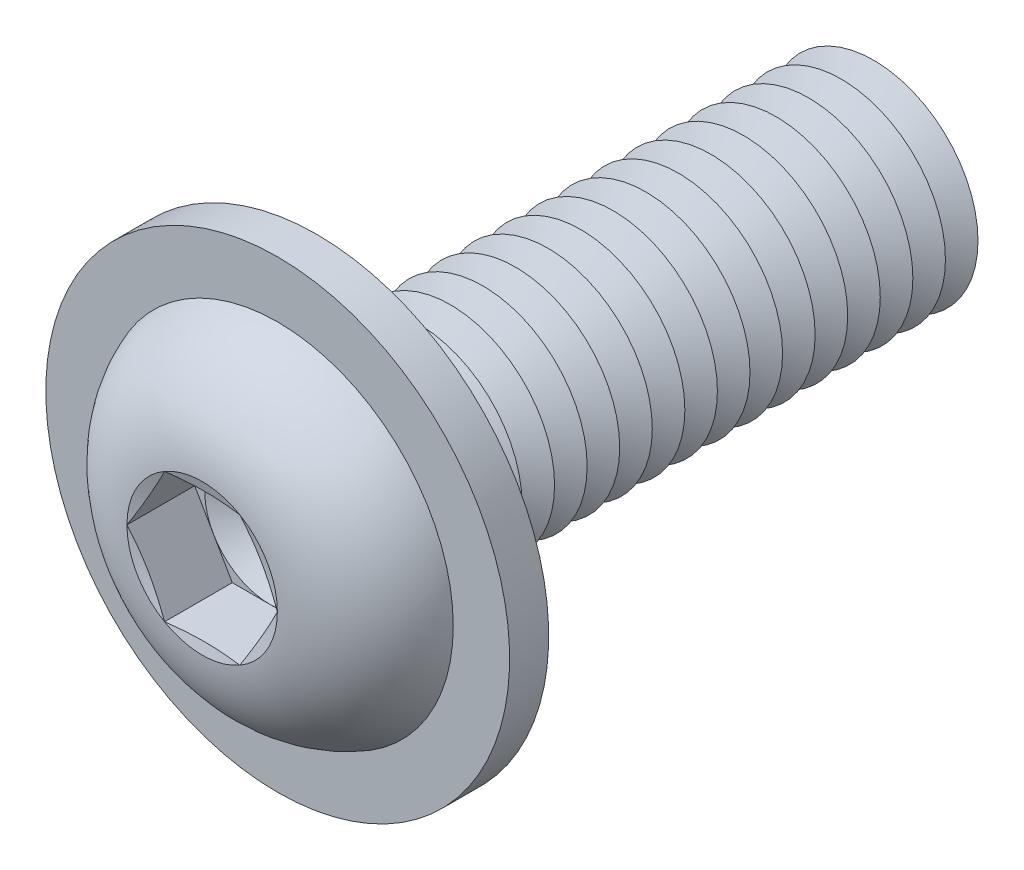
ISO-10303-21;
HEADER;
FILE_DESCRIPTION(('STEP AP214'),'2;1');
FILE_NAME('part.step','',(''),(''),'','','');
FILE_SCHEMA(('AUTOMOTIVE_DESIGN { 1 0 10303 214 1 1 1 1 }'));
ENDSEC;
DATA;
#1=APPLICATION_CONTEXT('core data for automotive mechanical design processes');
#2=APPLICATION_PROTOCOL_DEFINITION('international standard','automotive_design',2000,#1);
#3=PRODUCT_CONTEXT('',#1,'mechanical');
#4=PRODUCT('Part','Part','',(#3));
#5=PRODUCT_RELATED_PRODUCT_CATEGORY('part','',(#4));
#6=PRODUCT_DEFINITION_FORMATION('','',#4);
#7=PRODUCT_DEFINITION_CONTEXT('part definition',#1,'design');
#8=PRODUCT_DEFINITION('design','',#6,#7);
#9=PRODUCT_DEFINITION_SHAPE('','',#8);
#10=(LENGTH_UNIT() NAMED_UNIT(*) SI_UNIT(.MILLI.,.METRE.));
#11=(NAMED_UNIT(*) PLANE_ANGLE_UNIT() SI_UNIT($,.RADIAN.));
#12=(NAMED_UNIT(*) SI_UNIT($,.STERADIAN.) SOLID_ANGLE_UNIT());
#13=UNCERTAINTY_MEASURE_WITH_UNIT(LENGTH_MEASURE(1.E-05),#10,'distance_accuracy_value','');
#14=(GEOMETRIC_REPRESENTATION_CONTEXT(3) GLOBAL_UNCERTAINTY_ASSIGNED_CONTEXT((#13)) GLOBAL_UNIT_ASSIGNED_CONTEXT((#10,
#11,#12)) REPRESENTATION_CONTEXT('',''));
#15=CARTESIAN_POINT('',(0.,0.,0.));
#16=DIRECTION('',(0.,0.,1.));
#17=DIRECTION('',(1.,0.,0.));
#18=AXIS2_PLACEMENT_3D('',#15,#16,#17);
#19=CARTESIAN_POINT('',(0.,0.,-17.625));
#20=DIRECTION('',(0.,0.,1.));
#21=DIRECTION('',(1.,0.,0.));
#22=AXIS2_PLACEMENT_3D('',#19,#20,#21);
#23=CONICAL_SURFACE('',#22,4.00000000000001,1.0471975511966);
#24=CARTESIAN_POINT('',(0.,0.,-18.25));
#25=DIRECTION('',(0.,0.,1.));
#26=DIRECTION('',(1.,0.,0.));
#27=AXIS2_PLACEMENT_3D('',#24,#25,#26);
#28=CIRCLE('',#27,2.91746824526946);
#29=CARTESIAN_POINT('',(2.91746824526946,0.,-18.25));
#30=VERTEX_POINT('',#29);
#31=EDGE_CURVE('E347',#30,#30,#28,.T.);
#32=ORIENTED_EDGE('',*,*,#31,.T.);
#33=EDGE_LOOP('',(#32));
#34=FACE_BOUND('',#33,.T.);
#35=CARTESIAN_POINT('',(0.,0.,-17.625));
#36=DIRECTION('',(0.,0.,1.));
#37=DIRECTION('',(1.,0.,0.));
#38=AXIS2_PLACEMENT_3D('',#35,#36,#37);
#39=CIRCLE('',#38,4.00000000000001);
#40=CARTESIAN_POINT('',(4.00000000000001,0.,-17.625));
#41=VERTEX_POINT('',#40);
#42=EDGE_CURVE('E343',#41,#41,#39,.T.);
#43=ORIENTED_EDGE('',*,*,#42,.F.);
#44=EDGE_LOOP('',(#43));
#45=FACE_BOUND('',#44,.T.);
#46=ADVANCED_FACE('F39',(#34,#45),#23,.T.);
#47=CARTESIAN_POINT('',(0.,0.,-18.25));
#48=DIRECTION('',(0.,0.,-1.));
#49=DIRECTION('',(-1.,0.,0.));
#50=AXIS2_PLACEMENT_3D('',#47,#48,#49);
#51=CONICAL_SURFACE('',#50,2.91746824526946,1.0471975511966);
#52=CARTESIAN_POINT('',(0.,0.,-18.875));
#53=DIRECTION('',(0.,0.,1.));
#54=DIRECTION('',(1.,0.,0.));
#55=AXIS2_PLACEMENT_3D('',#52,#53,#54);
#56=CIRCLE('',#55,4.00000000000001);
#57=CARTESIAN_POINT('',(4.00000000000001,0.,-18.875));
#58=VERTEX_POINT('',#57);
#59=EDGE_CURVE('E351',#58,#58,#56,.T.);
#60=ORIENTED_EDGE('',*,*,#59,.T.);
#61=EDGE_LOOP('',(#60));
#62=FACE_BOUND('',#61,.T.);
#63=ORIENTED_EDGE('',*,*,#31,.F.);
#64=EDGE_LOOP('',(#63));
#65=FACE_BOUND('',#64,.T.);
#66=ADVANCED_FACE('F481',(#62,#65),#51,.T.);
#67=CARTESIAN_POINT('',(0.,4.00000000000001,-22.));
#68=DIRECTION('',(0.,0.,-1.));
#69=DIRECTION('',(-1.,0.,0.));
#70=AXIS2_PLACEMENT_3D('',#67,#68,#69);
#71=PLANE('',#70);
#72=CARTESIAN_POINT('',(0.,0.,-22.));
#73=DIRECTION('',(0.,0.,1.));
#74=DIRECTION('',(1.,0.,0.));
#75=AXIS2_PLACEMENT_3D('',#72,#73,#74);
#76=CIRCLE('',#75,2.91746824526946);
#77=CARTESIAN_POINT('',(2.91746824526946,0.,-22.));
#78=VERTEX_POINT('',#77);
#79=EDGE_CURVE('E371',#78,#78,#76,.T.);
#80=ORIENTED_EDGE('',*,*,#79,.F.);
#81=EDGE_LOOP('',(#80));
#82=FACE_BOUND('',#81,.T.);
#83=ADVANCED_FACE('F487',(#82),#71,.T.);
#84=CARTESIAN_POINT('',(0.,0.,-21.375));
#85=DIRECTION('',(0.,0.,1.));
#86=DIRECTION('',(1.,0.,0.));
#87=AXIS2_PLACEMENT_3D('',#84,#85,#86);
#88=CONICAL_SURFACE('',#87,4.00000000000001,1.0471975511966);
#89=ORIENTED_EDGE('',*,*,#79,.T.);
#90=EDGE_LOOP('',(#89));
#91=FACE_BOUND('',#90,.T.);
#92=CARTESIAN_POINT('',(0.,0.,-21.375));
#93=DIRECTION('',(0.,0.,1.));
#94=DIRECTION('',(1.,0.,0.));
#95=AXIS2_PLACEMENT_3D('',#92,#93,#94);
#96=CIRCLE('',#95,4.00000000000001);
#97=CARTESIAN_POINT('',(4.00000000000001,0.,-21.375));
#98=VERTEX_POINT('',#97);
#99=EDGE_CURVE('E367',#98,#98,#96,.T.);
#100=ORIENTED_EDGE('',*,*,#99,.F.);
#101=EDGE_LOOP('',(#100));
#102=FACE_BOUND('',#101,.T.);
#103=ADVANCED_FACE('F506',(#91,#102),#88,.T.);
#104=CARTESIAN_POINT('',(0.,0.,-20.75));
#105=DIRECTION('',(0.,0.,-1.));
#106=DIRECTION('',(-1.,0.,0.));
#107=AXIS2_PLACEMENT_3D('',#104,#105,#106);
#108=CONICAL_SURFACE('',#107,2.91746824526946,1.0471975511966);
#109=ORIENTED_EDGE('',*,*,#99,.T.);
#110=EDGE_LOOP('',(#109));
#111=FACE_BOUND('',#110,.T.);
#112=CARTESIAN_POINT('',(0.,0.,-20.75));
#113=DIRECTION('',(0.,0.,1.));
#114=DIRECTION('',(1.,0.,0.));
#115=AXIS2_PLACEMENT_3D('',#112,#113,#114);
#116=CIRCLE('',#115,2.91746824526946);
#117=CARTESIAN_POINT('',(2.91746824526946,0.,-20.75));
#118=VERTEX_POINT('',#117);
#119=EDGE_CURVE('E363',#118,#118,#116,.T.);
#120=ORIENTED_EDGE('',*,*,#119,.F.);
#121=EDGE_LOOP('',(#120));
#122=FACE_BOUND('',#121,.T.);
#123=ADVANCED_FACE('F503',(#111,#122),#108,.T.);
#124=CARTESIAN_POINT('',(0.,0.,-20.125));
#125=DIRECTION('',(0.,0.,1.));
#126=DIRECTION('',(1.,0.,0.));
#127=AXIS2_PLACEMENT_3D('',#124,#125,#126);
#128=CONICAL_SURFACE('',#127,4.00000000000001,1.0471975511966);
#129=ORIENTED_EDGE('',*,*,#119,.T.);
#130=EDGE_LOOP('',(#129));
#131=FACE_BOUND('',#130,.T.);
#132=CARTESIAN_POINT('',(0.,0.,-20.125));
#133=DIRECTION('',(0.,0.,1.));
#134=DIRECTION('',(1.,0.,0.));
#135=AXIS2_PLACEMENT_3D('',#132,#133,#134);
#136=CIRCLE('',#135,4.00000000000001);
#137=CARTESIAN_POINT('',(4.00000000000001,0.,-20.125));
#138=VERTEX_POINT('',#137);
#139=EDGE_CURVE('E359',#138,#138,#136,.T.);
#140=ORIENTED_EDGE('',*,*,#139,.F.);
#141=EDGE_LOOP('',(#140));
#142=FACE_BOUND('',#141,.T.);
#143=ADVANCED_FACE('F497',(#131,#142),#128,.T.);
#144=CARTESIAN_POINT('',(0.,0.,-19.5));
#145=DIRECTION('',(0.,0.,-1.));
#146=DIRECTION('',(-1.,0.,0.));
#147=AXIS2_PLACEMENT_3D('',#144,#145,#146);
#148=CONICAL_SURFACE('',#147,2.91746824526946,1.0471975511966);
#149=ORIENTED_EDGE('',*,*,#139,.T.);
#150=EDGE_LOOP('',(#149));
#151=FACE_BOUND('',#150,.T.);
#152=CARTESIAN_POINT('',(0.,0.,-19.5));
#153=DIRECTION('',(0.,0.,1.));
#154=DIRECTION('',(1.,0.,0.));
#155=AXIS2_PLACEMENT_3D('',#152,#153,#154);
#156=CIRCLE('',#155,2.91746824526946);
#157=CARTESIAN_POINT('',(2.91746824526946,0.,-19.5));
#158=VERTEX_POINT('',#157);
#159=EDGE_CURVE('E355',#158,#158,#156,.T.);
#160=ORIENTED_EDGE('',*,*,#159,.F.);
#161=EDGE_LOOP('',(#160));
#162=FACE_BOUND('',#161,.T.);
#163=ADVANCED_FACE('F493',(#151,#162),#148,.T.);
#164=CARTESIAN_POINT('',(0.,0.,-18.875));
#165=DIRECTION('',(0.,0.,1.));
#166=DIRECTION('',(1.,0.,0.));
#167=AXIS2_PLACEMENT_3D('',#164,#165,#166);
#168=CONICAL_SURFACE('',#167,4.00000000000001,1.0471975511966);
#169=ORIENTED_EDGE('',*,*,#159,.T.);
#170=EDGE_LOOP('',(#169));
#171=FACE_BOUND('',#170,.T.);
#172=ORIENTED_EDGE('',*,*,#59,.F.);
#173=EDGE_LOOP('',(#172));
#174=FACE_BOUND('',#173,.T.);
#175=ADVANCED_FACE('F496',(#171,#174),#168,.T.);
#176=CARTESIAN_POINT('',(0.,0.,-16.375));
#177=DIRECTION('',(0.,0.,1.));
#178=DIRECTION('',(1.,0.,0.));
#179=AXIS2_PLACEMENT_3D('',#176,#177,#178);
#180=CONICAL_SURFACE('',#179,4.00000000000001,1.0471975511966);
#181=CARTESIAN_POINT('',(0.,0.,-17.));
#182=DIRECTION('',(0.,0.,1.));
#183=DIRECTION('',(1.,0.,0.));
#184=AXIS2_PLACEMENT_3D('',#181,#182,#183);
#185=CIRCLE('',#184,2.91746824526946);
#186=CARTESIAN_POINT('',(2.91746824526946,0.,-17.));
#187=VERTEX_POINT('',#186);
#188=EDGE_CURVE('E339',#187,#187,#185,.T.);
#189=ORIENTED_EDGE('',*,*,#188,.T.);
#190=EDGE_LOOP('',(#189));
#191=FACE_BOUND('',#190,.T.);
#192=CARTESIAN_POINT('',(0.,0.,-16.375));
#193=DIRECTION('',(0.,0.,1.));
#194=DIRECTION('',(1.,0.,0.));
#195=AXIS2_PLACEMENT_3D('',#192,#193,#194);
#196=CIRCLE('',#195,4.00000000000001);
#197=CARTESIAN_POINT('',(4.00000000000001,0.,-16.375));
#198=VERTEX_POINT('',#197);
#199=EDGE_CURVE('E335',#198,#198,#196,.T.);
#200=ORIENTED_EDGE('',*,*,#199,.F.);
#201=EDGE_LOOP('',(#200));
#202=FACE_BOUND('',#201,.T.);
#203=ADVANCED_FACE('F501',(#191,#202),#180,.T.);
#204=CARTESIAN_POINT('',(0.,0.,-17.));
#205=DIRECTION('',(0.,0.,-1.));
#206=DIRECTION('',(-1.,0.,0.));
#207=AXIS2_PLACEMENT_3D('',#204,#205,#206);
#208=CONICAL_SURFACE('',#207,2.91746824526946,1.0471975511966);
#209=ORIENTED_EDGE('',*,*,#42,.T.);
#210=EDGE_LOOP('',(#209));
#211=FACE_BOUND('',#210,.T.);
#212=ORIENTED_EDGE('',*,*,#188,.F.);
#213=EDGE_LOOP('',(#212));
#214=FACE_BOUND('',#213,.T.);
#215=ADVANCED_FACE('F552',(#211,#214),#208,.T.);
#216=CARTESIAN_POINT('',(0.,0.,-15.125));
#217=DIRECTION('',(0.,0.,1.));
#218=DIRECTION('',(1.,0.,0.));
#219=AXIS2_PLACEMENT_3D('',#216,#217,#218);
#220=CONICAL_SURFACE('',#219,4.00000000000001,1.0471975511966);
#221=CARTESIAN_POINT('',(0.,0.,-15.75));
#222=DIRECTION('',(0.,0.,1.));
#223=DIRECTION('',(1.,0.,0.));
#224=AXIS2_PLACEMENT_3D('',#221,#222,#223);
#225=CIRCLE('',#224,2.91746824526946);
#226=CARTESIAN_POINT('',(2.91746824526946,0.,-15.75));
#227=VERTEX_POINT('',#226);
#228=EDGE_CURVE('E331',#227,#227,#225,.T.);
#229=ORIENTED_EDGE('',*,*,#228,.T.);
#230=EDGE_LOOP('',(#229));
#231=FACE_BOUND('',#230,.T.);
#232=CARTESIAN_POINT('',(0.,0.,-15.125));
#233=DIRECTION('',(0.,0.,1.));
#234=DIRECTION('',(1.,0.,0.));
#235=AXIS2_PLACEMENT_3D('',#232,#233,#234);
#236=CIRCLE('',#235,4.00000000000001);
#237=CARTESIAN_POINT('',(4.00000000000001,0.,-15.125));
#238=VERTEX_POINT('',#237);
#239=EDGE_CURVE('E327',#238,#238,#236,.T.);
#240=ORIENTED_EDGE('',*,*,#239,.F.);
#241=EDGE_LOOP('',(#240));
#242=FACE_BOUND('',#241,.T.);
#243=ADVANCED_FACE('F558',(#231,#242),#220,.T.);
#244=CARTESIAN_POINT('',(0.,0.,-15.75));
#245=DIRECTION('',(0.,0.,-1.));
#246=DIRECTION('',(-1.,0.,0.));
#247=AXIS2_PLACEMENT_3D('',#244,#245,#246);
#248=CONICAL_SURFACE('',#247,2.91746824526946,1.0471975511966);
#249=ORIENTED_EDGE('',*,*,#199,.T.);
#250=EDGE_LOOP('',(#249));
#251=FACE_BOUND('',#250,.T.);
#252=ORIENTED_EDGE('',*,*,#228,.F.);
#253=EDGE_LOOP('',(#252));
#254=FACE_BOUND('',#253,.T.);
#255=ADVANCED_FACE('F565',(#251,#254),#248,.T.);
#256=CARTESIAN_POINT('',(0.,0.,-13.875));
#257=DIRECTION('',(0.,0.,1.));
#258=DIRECTION('',(1.,0.,0.));
#259=AXIS2_PLACEMENT_3D('',#256,#257,#258);
#260=CONICAL_SURFACE('',#259,4.00000000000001,1.0471975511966);
#261=CARTESIAN_POINT('',(0.,0.,-14.5));
#262=DIRECTION('',(0.,0.,1.));
#263=DIRECTION('',(1.,0.,0.));
#264=AXIS2_PLACEMENT_3D('',#261,#262,#263);
#265=CIRCLE('',#264,2.91746824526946);
#266=CARTESIAN_POINT('',(2.91746824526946,0.,-14.5));
#267=VERTEX_POINT('',#266);
#268=EDGE_CURVE('E323',#267,#267,#265,.T.);
#269=ORIENTED_EDGE('',*,*,#268,.T.);
#270=EDGE_LOOP('',(#269));
#271=FACE_BOUND('',#270,.T.);
#272=CARTESIAN_POINT('',(0.,0.,-13.875));
#273=DIRECTION('',(0.,0.,1.));
#274=DIRECTION('',(1.,0.,0.));
#275=AXIS2_PLACEMENT_3D('',#272,#273,#274);
#276=CIRCLE('',#275,4.00000000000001);
#277=CARTESIAN_POINT('',(4.00000000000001,0.,-13.875));
#278=VERTEX_POINT('',#277);
#279=EDGE_CURVE('E319',#278,#278,#276,.T.);
#280=ORIENTED_EDGE('',*,*,#279,.F.);
#281=EDGE_LOOP('',(#280));
#282=FACE_BOUND('',#281,.T.);
#283=ADVANCED_FACE('F572',(#271,#282),#260,.T.);
#284=CARTESIAN_POINT('',(0.,0.,-14.5));
#285=DIRECTION('',(0.,0.,-1.));
#286=DIRECTION('',(-1.,0.,0.));
#287=AXIS2_PLACEMENT_3D('',#284,#285,#286);
#288=CONICAL_SURFACE('',#287,2.91746824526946,1.0471975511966);
#289=ORIENTED_EDGE('',*,*,#239,.T.);
#290=EDGE_LOOP('',(#289));
#291=FACE_BOUND('',#290,.T.);
#292=ORIENTED_EDGE('',*,*,#268,.F.);
#293=EDGE_LOOP('',(#292));
#294=FACE_BOUND('',#293,.T.);
#295=ADVANCED_FACE('F579',(#291,#294),#288,.T.);
#296=CARTESIAN_POINT('',(0.,0.,-12.625));
#297=DIRECTION('',(0.,0.,1.));
#298=DIRECTION('',(1.,0.,0.));
#299=AXIS2_PLACEMENT_3D('',#296,#297,#298);
#300=CONICAL_SURFACE('',#299,4.00000000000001,1.0471975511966);
#301=CARTESIAN_POINT('',(0.,0.,-13.25));
#302=DIRECTION('',(0.,0.,1.));
#303=DIRECTION('',(1.,0.,0.));
#304=AXIS2_PLACEMENT_3D('',#301,#302,#303);
#305=CIRCLE('',#304,2.91746824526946);
#306=CARTESIAN_POINT('',(2.91746824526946,0.,-13.25));
#307=VERTEX_POINT('',#306);
#308=EDGE_CURVE('E315',#307,#307,#305,.T.);
#309=ORIENTED_EDGE('',*,*,#308,.T.);
#310=EDGE_LOOP('',(#309));
#311=FACE_BOUND('',#310,.T.);
#312=CARTESIAN_POINT('',(0.,0.,-12.625));
#313=DIRECTION('',(0.,0.,1.));
#314=DIRECTION('',(1.,0.,0.));
#315=AXIS2_PLACEMENT_3D('',#312,#313,#314);
#316=CIRCLE('',#315,4.00000000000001);
#317=CARTESIAN_POINT('',(4.00000000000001,0.,-12.625));
#318=VERTEX_POINT('',#317);
#319=EDGE_CURVE('E311',#318,#318,#316,.T.);
#320=ORIENTED_EDGE('',*,*,#319,.F.);
#321=EDGE_LOOP('',(#320));
#322=FACE_BOUND('',#321,.T.);
#323=ADVANCED_FACE('F586',(#311,#322),#300,.T.);
#324=CARTESIAN_POINT('',(0.,0.,-13.25));
#325=DIRECTION('',(0.,0.,-1.));
#326=DIRECTION('',(-1.,0.,0.));
#327=AXIS2_PLACEMENT_3D('',#324,#325,#326);
#328=CONICAL_SURFACE('',#327,2.91746824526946,1.0471975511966);
#329=ORIENTED_EDGE('',*,*,#279,.T.);
#330=EDGE_LOOP('',(#329));
#331=FACE_BOUND('',#330,.T.);
#332=ORIENTED_EDGE('',*,*,#308,.F.);
#333=EDGE_LOOP('',(#332));
#334=FACE_BOUND('',#333,.T.);
#335=ADVANCED_FACE('F593',(#331,#334),#328,.T.);
#336=CARTESIAN_POINT('',(0.,0.,-11.375));
#337=DIRECTION('',(0.,0.,1.));
#338=DIRECTION('',(1.,0.,0.));
#339=AXIS2_PLACEMENT_3D('',#336,#337,#338);
#340=CONICAL_SURFACE('',#339,4.00000000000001,1.0471975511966);
#341=CARTESIAN_POINT('',(0.,0.,-12.));
#342=DIRECTION('',(0.,0.,1.));
#343=DIRECTION('',(1.,0.,0.));
#344=AXIS2_PLACEMENT_3D('',#341,#342,#343);
#345=CIRCLE('',#344,2.91746824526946);
#346=CARTESIAN_POINT('',(2.91746824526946,0.,-12.));
#347=VERTEX_POINT('',#346);
#348=EDGE_CURVE('E307',#347,#347,#345,.T.);
#349=ORIENTED_EDGE('',*,*,#348,.T.);
#350=EDGE_LOOP('',(#349));
#351=FACE_BOUND('',#350,.T.);
#352=CARTESIAN_POINT('',(0.,0.,-11.375));
#353=DIRECTION('',(0.,0.,1.));
#354=DIRECTION('',(1.,0.,0.));
#355=AXIS2_PLACEMENT_3D('',#352,#353,#354);
#356=CIRCLE('',#355,4.00000000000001);
#357=CARTESIAN_POINT('',(4.00000000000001,0.,-11.375));
#358=VERTEX_POINT('',#357);
#359=EDGE_CURVE('E303',#358,#358,#356,.T.);
#360=ORIENTED_EDGE('',*,*,#359,.F.);
#361=EDGE_LOOP('',(#360));
#362=FACE_BOUND('',#361,.T.);
#363=ADVANCED_FACE('F600',(#351,#362),#340,.T.);
#364=CARTESIAN_POINT('',(0.,0.,-12.));
#365=DIRECTION('',(0.,0.,-1.));
#366=DIRECTION('',(-1.,0.,0.));
#367=AXIS2_PLACEMENT_3D('',#364,#365,#366);
#368=CONICAL_SURFACE('',#367,2.91746824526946,1.0471975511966);
#369=ORIENTED_EDGE('',*,*,#319,.T.);
#370=EDGE_LOOP('',(#369));
#371=FACE_BOUND('',#370,.T.);
#372=ORIENTED_EDGE('',*,*,#348,.F.);
#373=EDGE_LOOP('',(#372));
#374=FACE_BOUND('',#373,.T.);
#375=ADVANCED_FACE('F607',(#371,#374),#368,.T.);
#376=CARTESIAN_POINT('',(0.,0.,-10.125));
#377=DIRECTION('',(0.,0.,1.));
#378=DIRECTION('',(1.,0.,0.));
#379=AXIS2_PLACEMENT_3D('',#376,#377,#378);
#380=CONICAL_SURFACE('',#379,4.00000000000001,1.0471975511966);
#381=CARTESIAN_POINT('',(0.,0.,-10.75));
#382=DIRECTION('',(0.,0.,1.));
#383=DIRECTION('',(1.,0.,0.));
#384=AXIS2_PLACEMENT_3D('',#381,#382,#383);
#385=CIRCLE('',#384,2.91746824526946);
#386=CARTESIAN_POINT('',(2.91746824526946,0.,-10.75));
#387=VERTEX_POINT('',#386);
#388=EDGE_CURVE('E299',#387,#387,#385,.T.);
#389=ORIENTED_EDGE('',*,*,#388,.T.);
#390=EDGE_LOOP('',(#389));
#391=FACE_BOUND('',#390,.T.);
#392=CARTESIAN_POINT('',(0.,0.,-10.125));
#393=DIRECTION('',(0.,0.,1.));
#394=DIRECTION('',(1.,0.,0.));
#395=AXIS2_PLACEMENT_3D('',#392,#393,#394);
#396=CIRCLE('',#395,4.00000000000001);
#397=CARTESIAN_POINT('',(4.00000000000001,0.,-10.125));
#398=VERTEX_POINT('',#397);
#399=EDGE_CURVE('E295',#398,#398,#396,.T.);
#400=ORIENTED_EDGE('',*,*,#399,.F.);
#401=EDGE_LOOP('',(#400));
#402=FACE_BOUND('',#401,.T.);
#403=ADVANCED_FACE('F614',(#391,#402),#380,.T.);
#404=CARTESIAN_POINT('',(0.,0.,-10.75));
#405=DIRECTION('',(0.,0.,-1.));
#406=DIRECTION('',(-1.,0.,0.));
#407=AXIS2_PLACEMENT_3D('',#404,#405,#406);
#408=CONICAL_SURFACE('',#407,2.91746824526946,1.0471975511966);
#409=ORIENTED_EDGE('',*,*,#359,.T.);
#410=EDGE_LOOP('',(#409));
#411=FACE_BOUND('',#410,.T.);
#412=ORIENTED_EDGE('',*,*,#388,.F.);
#413=EDGE_LOOP('',(#412));
#414=FACE_BOUND('',#413,.T.);
#415=ADVANCED_FACE('F621',(#411,#414),#408,.T.);
#416=CARTESIAN_POINT('',(0.,0.,-8.875));
#417=DIRECTION('',(0.,0.,1.));
#418=DIRECTION('',(1.,0.,0.));
#419=AXIS2_PLACEMENT_3D('',#416,#417,#418);
#420=CONICAL_SURFACE('',#419,4.00000000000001,1.0471975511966);
#421=CARTESIAN_POINT('',(0.,0.,-9.5));
#422=DIRECTION('',(0.,0.,1.));
#423=DIRECTION('',(1.,0.,0.));
#424=AXIS2_PLACEMENT_3D('',#421,#422,#423);
#425=CIRCLE('',#424,2.91746824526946);
#426=CARTESIAN_POINT('',(2.91746824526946,0.,-9.5));
#427=VERTEX_POINT('',#426);
#428=EDGE_CURVE('E291',#427,#427,#425,.T.);
#429=ORIENTED_EDGE('',*,*,#428,.T.);
#430=EDGE_LOOP('',(#429));
#431=FACE_BOUND('',#430,.T.);
#432=CARTESIAN_POINT('',(0.,0.,-8.875));
#433=DIRECTION('',(0.,0.,1.));
#434=DIRECTION('',(1.,0.,0.));
#435=AXIS2_PLACEMENT_3D('',#432,#433,#434);
#436=CIRCLE('',#435,4.00000000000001);
#437=CARTESIAN_POINT('',(4.00000000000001,0.,-8.875));
#438=VERTEX_POINT('',#437);
#439=EDGE_CURVE('E287',#438,#438,#436,.T.);
#440=ORIENTED_EDGE('',*,*,#439,.F.);
#441=EDGE_LOOP('',(#440));
#442=FACE_BOUND('',#441,.T.);
#443=ADVANCED_FACE('F628',(#431,#442),#420,.T.);
#444=CARTESIAN_POINT('',(0.,0.,-9.5));
#445=DIRECTION('',(0.,0.,-1.));
#446=DIRECTION('',(-1.,0.,0.));
#447=AXIS2_PLACEMENT_3D('',#444,#445,#446);
#448=CONICAL_SURFACE('',#447,2.91746824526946,1.0471975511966);
#449=ORIENTED_EDGE('',*,*,#399,.T.);
#450=EDGE_LOOP('',(#449));
#451=FACE_BOUND('',#450,.T.);
#452=ORIENTED_EDGE('',*,*,#428,.F.);
#453=EDGE_LOOP('',(#452));
#454=FACE_BOUND('',#453,.T.);
#455=ADVANCED_FACE('F635',(#451,#454),#448,.T.);
#456=CARTESIAN_POINT('',(0.,0.,-7.625));
#457=DIRECTION('',(0.,0.,1.));
#458=DIRECTION('',(1.,0.,0.));
#459=AXIS2_PLACEMENT_3D('',#456,#457,#458);
#460=CONICAL_SURFACE('',#459,4.00000000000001,1.0471975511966);
#461=CARTESIAN_POINT('',(0.,0.,-8.25));
#462=DIRECTION('',(0.,0.,1.));
#463=DIRECTION('',(1.,0.,0.));
#464=AXIS2_PLACEMENT_3D('',#461,#462,#463);
#465=CIRCLE('',#464,2.91746824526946);
#466=CARTESIAN_POINT('',(2.91746824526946,0.,-8.25));
#467=VERTEX_POINT('',#466);
#468=EDGE_CURVE('E283',#467,#467,#465,.T.);
#469=ORIENTED_EDGE('',*,*,#468,.T.);
#470=EDGE_LOOP('',(#469));
#471=FACE_BOUND('',#470,.T.);
#472=CARTESIAN_POINT('',(0.,0.,-7.625));
#473=DIRECTION('',(0.,0.,1.));
#474=DIRECTION('',(1.,0.,0.));
#475=AXIS2_PLACEMENT_3D('',#472,#473,#474);
#476=CIRCLE('',#475,4.00000000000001);
#477=CARTESIAN_POINT('',(4.00000000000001,0.,-7.625));
#478=VERTEX_POINT('',#477);
#479=EDGE_CURVE('E279',#478,#478,#476,.T.);
#480=ORIENTED_EDGE('',*,*,#479,.F.);
#481=EDGE_LOOP('',(#480));
#482=FACE_BOUND('',#481,.T.);
#483=ADVANCED_FACE('F642',(#471,#482),#460,.T.);
#484=CARTESIAN_POINT('',(0.,0.,-8.25));
#485=DIRECTION('',(0.,0.,-1.));
#486=DIRECTION('',(-1.,0.,0.));
#487=AXIS2_PLACEMENT_3D('',#484,#485,#486);
#488=CONICAL_SURFACE('',#487,2.91746824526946,1.0471975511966);
#489=ORIENTED_EDGE('',*,*,#439,.T.);
#490=EDGE_LOOP('',(#489));
#491=FACE_BOUND('',#490,.T.);
#492=ORIENTED_EDGE('',*,*,#468,.F.);
#493=EDGE_LOOP('',(#492));
#494=FACE_BOUND('',#493,.T.);
#495=ADVANCED_FACE('F649',(#491,#494),#488,.T.);
#496=CARTESIAN_POINT('',(0.,0.,-6.375));
#497=DIRECTION('',(0.,0.,1.));
#498=DIRECTION('',(1.,0.,0.));
#499=AXIS2_PLACEMENT_3D('',#496,#497,#498);
#500=CONICAL_SURFACE('',#499,4.00000000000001,1.0471975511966);
#501=CARTESIAN_POINT('',(0.,0.,-7.));
#502=DIRECTION('',(0.,0.,1.));
#503=DIRECTION('',(1.,0.,0.));
#504=AXIS2_PLACEMENT_3D('',#501,#502,#503);
#505=CIRCLE('',#504,2.91746824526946);
#506=CARTESIAN_POINT('',(2.91746824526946,0.,-7.));
#507=VERTEX_POINT('',#506);
#508=EDGE_CURVE('E275',#507,#507,#505,.T.);
#509=ORIENTED_EDGE('',*,*,#508,.T.);
#510=EDGE_LOOP('',(#509));
#511=FACE_BOUND('',#510,.T.);
#512=CARTESIAN_POINT('',(0.,0.,-6.375));
#513=DIRECTION('',(0.,0.,1.));
#514=DIRECTION('',(1.,0.,0.));
#515=AXIS2_PLACEMENT_3D('',#512,#513,#514);
#516=CIRCLE('',#515,4.00000000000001);
#517=CARTESIAN_POINT('',(4.00000000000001,0.,-6.375));
#518=VERTEX_POINT('',#517);
#519=EDGE_CURVE('E271',#518,#518,#516,.T.);
#520=ORIENTED_EDGE('',*,*,#519,.F.);
#521=EDGE_LOOP('',(#520));
#522=FACE_BOUND('',#521,.T.);
#523=ADVANCED_FACE('F656',(#511,#522),#500,.T.);
#524=CARTESIAN_POINT('',(0.,0.,-7.));
#525=DIRECTION('',(0.,0.,-1.));
#526=DIRECTION('',(-1.,0.,0.));
#527=AXIS2_PLACEMENT_3D('',#524,#525,#526);
#528=CONICAL_SURFACE('',#527,2.91746824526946,1.0471975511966);
#529=ORIENTED_EDGE('',*,*,#479,.T.);
#530=EDGE_LOOP('',(#529));
#531=FACE_BOUND('',#530,.T.);
#532=ORIENTED_EDGE('',*,*,#508,.F.);
#533=EDGE_LOOP('',(#532));
#534=FACE_BOUND('',#533,.T.);
#535=ADVANCED_FACE('F663',(#531,#534),#528,.T.);
#536=CARTESIAN_POINT('',(0.,0.,-5.125));
#537=DIRECTION('',(0.,0.,1.));
#538=DIRECTION('',(1.,0.,0.));
#539=AXIS2_PLACEMENT_3D('',#536,#537,#538);
#540=CONICAL_SURFACE('',#539,4.00000000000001,1.0471975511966);
#541=CARTESIAN_POINT('',(0.,0.,-5.75));
#542=DIRECTION('',(0.,0.,1.));
#543=DIRECTION('',(1.,0.,0.));
#544=AXIS2_PLACEMENT_3D('',#541,#542,#543);
#545=CIRCLE('',#544,2.91746824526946);
#546=CARTESIAN_POINT('',(2.91746824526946,0.,-5.75));
#547=VERTEX_POINT('',#546);
#548=EDGE_CURVE('E267',#547,#547,#545,.T.);
#549=ORIENTED_EDGE('',*,*,#548,.T.);
#550=EDGE_LOOP('',(#549));
#551=FACE_BOUND('',#550,.T.);
#552=CARTESIAN_POINT('',(0.,0.,-5.125));
#553=DIRECTION('',(0.,0.,1.));
#554=DIRECTION('',(1.,0.,0.));
#555=AXIS2_PLACEMENT_3D('',#552,#553,#554);
#556=CIRCLE('',#555,4.00000000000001);
#557=CARTESIAN_POINT('',(4.00000000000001,0.,-5.125));
#558=VERTEX_POINT('',#557);
#559=EDGE_CURVE('E263',#558,#558,#556,.T.);
#560=ORIENTED_EDGE('',*,*,#559,.F.);
#561=EDGE_LOOP('',(#560));
#562=FACE_BOUND('',#561,.T.);
#563=ADVANCED_FACE('F670',(#551,#562),#540,.T.);
#564=CARTESIAN_POINT('',(0.,0.,-5.75));
#565=DIRECTION('',(0.,0.,-1.));
#566=DIRECTION('',(-1.,0.,0.));
#567=AXIS2_PLACEMENT_3D('',#564,#565,#566);
#568=CONICAL_SURFACE('',#567,2.91746824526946,1.0471975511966);
#569=ORIENTED_EDGE('',*,*,#519,.T.);
#570=EDGE_LOOP('',(#569));
#571=FACE_BOUND('',#570,.T.);
#572=ORIENTED_EDGE('',*,*,#548,.F.);
#573=EDGE_LOOP('',(#572));
#574=FACE_BOUND('',#573,.T.);
#575=ADVANCED_FACE('F677',(#571,#574),#568,.T.);
#576=CARTESIAN_POINT('',(0.,0.,-3.875));
#577=DIRECTION('',(0.,0.,1.));
#578=DIRECTION('',(1.,0.,0.));
#579=AXIS2_PLACEMENT_3D('',#576,#577,#578);
#580=CONICAL_SURFACE('',#579,4.00000000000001,1.0471975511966);
#581=CARTESIAN_POINT('',(0.,0.,-4.5));
#582=DIRECTION('',(0.,0.,1.));
#583=DIRECTION('',(1.,0.,0.));
#584=AXIS2_PLACEMENT_3D('',#581,#582,#583);
#585=CIRCLE('',#584,2.91746824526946);
#586=CARTESIAN_POINT('',(2.91746824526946,0.,-4.5));
#587=VERTEX_POINT('',#586);
#588=EDGE_CURVE('E259',#587,#587,#585,.T.);
#589=ORIENTED_EDGE('',*,*,#588,.T.);
#590=EDGE_LOOP('',(#589));
#591=FACE_BOUND('',#590,.T.);
#592=CARTESIAN_POINT('',(0.,0.,-3.875));
#593=DIRECTION('',(0.,0.,1.));
#594=DIRECTION('',(1.,0.,0.));
#595=AXIS2_PLACEMENT_3D('',#592,#593,#594);
#596=CIRCLE('',#595,4.00000000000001);
#597=CARTESIAN_POINT('',(4.00000000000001,0.,-3.875));
#598=VERTEX_POINT('',#597);
#599=EDGE_CURVE('E255',#598,#598,#596,.T.);
#600=ORIENTED_EDGE('',*,*,#599,.F.);
#601=EDGE_LOOP('',(#600));
#602=FACE_BOUND('',#601,.T.);
#603=ADVANCED_FACE('F684',(#591,#602),#580,.T.);
#604=CARTESIAN_POINT('',(0.,0.,-4.5));
#605=DIRECTION('',(0.,0.,-1.));
#606=DIRECTION('',(-1.,0.,0.));
#607=AXIS2_PLACEMENT_3D('',#604,#605,#606);
#608=CONICAL_SURFACE('',#607,2.91746824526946,1.0471975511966);
#609=ORIENTED_EDGE('',*,*,#559,.T.);
#610=EDGE_LOOP('',(#609));
#611=FACE_BOUND('',#610,.T.);
#612=ORIENTED_EDGE('',*,*,#588,.F.);
#613=EDGE_LOOP('',(#612));
#614=FACE_BOUND('',#613,.T.);
#615=ADVANCED_FACE('F691',(#611,#614),#608,.T.);
#616=CARTESIAN_POINT('',(0.,0.,-2.625));
#617=DIRECTION('',(0.,0.,1.));
#618=DIRECTION('',(1.,0.,0.));
#619=AXIS2_PLACEMENT_3D('',#616,#617,#618);
#620=CONICAL_SURFACE('',#619,4.00000000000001,1.0471975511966);
#621=CARTESIAN_POINT('',(0.,0.,-3.25));
#622=DIRECTION('',(0.,0.,1.));
#623=DIRECTION('',(1.,0.,0.));
#624=AXIS2_PLACEMENT_3D('',#621,#622,#623);
#625=CIRCLE('',#624,2.91746824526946);
#626=CARTESIAN_POINT('',(2.91746824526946,0.,-3.25));
#627=VERTEX_POINT('',#626);
#628=EDGE_CURVE('E251',#627,#627,#625,.T.);
#629=ORIENTED_EDGE('',*,*,#628,.T.);
#630=EDGE_LOOP('',(#629));
#631=FACE_BOUND('',#630,.T.);
#632=CARTESIAN_POINT('',(0.,0.,-2.625));
#633=DIRECTION('',(0.,0.,1.));
#634=DIRECTION('',(1.,0.,0.));
#635=AXIS2_PLACEMENT_3D('',#632,#633,#634);
#636=CIRCLE('',#635,4.00000000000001);
#637=CARTESIAN_POINT('',(4.00000000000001,0.,-2.625));
#638=VERTEX_POINT('',#637);
#639=EDGE_CURVE('E243',#638,#638,#636,.T.);
#640=ORIENTED_EDGE('',*,*,#639,.F.);
#641=EDGE_LOOP('',(#640));
#642=FACE_BOUND('',#641,.T.);
#643=ADVANCED_FACE('F698',(#631,#642),#620,.T.);
#644=CARTESIAN_POINT('',(0.,0.,-3.25));
#645=DIRECTION('',(0.,0.,-1.));
#646=DIRECTION('',(-1.,0.,0.));
#647=AXIS2_PLACEMENT_3D('',#644,#645,#646);
#648=CONICAL_SURFACE('',#647,2.91746824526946,1.0471975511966);
#649=ORIENTED_EDGE('',*,*,#599,.T.);
#650=EDGE_LOOP('',(#649));
#651=FACE_BOUND('',#650,.T.);
#652=ORIENTED_EDGE('',*,*,#628,.F.);
#653=EDGE_LOOP('',(#652));
#654=FACE_BOUND('',#653,.T.);
#655=ADVANCED_FACE('F705',(#651,#654),#648,.T.);
#656=CARTESIAN_POINT('',(0.,0.,-1.375));
#657=DIRECTION('',(0.,0.,1.));
#658=DIRECTION('',(1.,0.,0.));
#659=AXIS2_PLACEMENT_3D('',#656,#657,#658);
#660=CONICAL_SURFACE('',#659,4.00000000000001,1.0471975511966);
#661=CARTESIAN_POINT('',(0.,0.,-2.));
#662=DIRECTION('',(0.,0.,1.));
#663=DIRECTION('',(1.,0.,0.));
#664=AXIS2_PLACEMENT_3D('',#661,#662,#663);
#665=CIRCLE('',#664,2.91746824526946);
#666=CARTESIAN_POINT('',(2.91746824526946,0.,-2.));
#667=VERTEX_POINT('',#666);
#668=EDGE_CURVE('E232',#667,#667,#665,.T.);
#669=ORIENTED_EDGE('',*,*,#668,.T.);
#670=EDGE_LOOP('',(#669));
#671=FACE_BOUND('',#670,.T.);
#672=CARTESIAN_POINT('',(0.,0.,-1.375));
#673=DIRECTION('',(0.,0.,1.));
#674=DIRECTION('',(1.,0.,0.));
#675=AXIS2_PLACEMENT_3D('',#672,#673,#674);
#676=CIRCLE('',#675,4.00000000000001);
#677=CARTESIAN_POINT('',(4.00000000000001,0.,-1.375));
#678=VERTEX_POINT('',#677);
#679=EDGE_CURVE('E247',#678,#678,#676,.T.);
#680=ORIENTED_EDGE('',*,*,#679,.F.);
#681=EDGE_LOOP('',(#680));
#682=FACE_BOUND('',#681,.T.);
#683=ADVANCED_FACE('F712',(#671,#682),#660,.T.);
#684=CARTESIAN_POINT('',(0.,0.,-2.));
#685=DIRECTION('',(0.,0.,-1.));
#686=DIRECTION('',(-1.,0.,0.));
#687=AXIS2_PLACEMENT_3D('',#684,#685,#686);
#688=CONICAL_SURFACE('',#687,2.91746824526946,1.0471975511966);
#689=ORIENTED_EDGE('',*,*,#639,.T.);
#690=EDGE_LOOP('',(#689));
#691=FACE_BOUND('',#690,.T.);
#692=ORIENTED_EDGE('',*,*,#668,.F.);
#693=EDGE_LOOP('',(#692));
#694=FACE_BOUND('',#693,.T.);
#695=ADVANCED_FACE('F221',(#691,#694),#688,.T.);
#696=CARTESIAN_POINT('',(0.,4.,0.));
#697=DIRECTION('',(0.,0.,-1.));
#698=DIRECTION('',(-1.,0.,0.));
#699=AXIS2_PLACEMENT_3D('',#696,#697,#698);
#700=PLANE('',#699);
#701=CARTESIAN_POINT('',(0.,0.,0.));
#702=DIRECTION('',(0.,0.,-1.));
#703=DIRECTION('',(-1.,0.,0.));
#704=AXIS2_PLACEMENT_3D('',#701,#702,#703);
#705=CIRCLE('',#704,4.62500000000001);
#706=CARTESIAN_POINT('',(-4.62500000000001,0.,0.));
#707=VERTEX_POINT('',#706);
#708=EDGE_CURVE('E384',#707,#707,#705,.F.);
#709=ORIENTED_EDGE('',*,*,#708,.T.);
#710=EDGE_LOOP('',(#709));
#711=FACE_BOUND('',#710,.T.);
#712=CARTESIAN_POINT('',(0.,0.,0.));
#713=DIRECTION('',(0.,0.,-1.));
#714=DIRECTION('',(0.,1.,0.));
#715=AXIS2_PLACEMENT_3D('',#712,#713,#714);
#716=CIRCLE('',#715,8.9);
#717=CARTESIAN_POINT('',(0.,8.9,0.));
#718=VERTEX_POINT('',#717);
#719=EDGE_CURVE('E1084',#718,#718,#716,.T.);
#720=ORIENTED_EDGE('',*,*,#719,.T.);
#721=EDGE_LOOP('',(#720));
#722=FACE_BOUND('',#721,.T.);
#723=ADVANCED_FACE('F724',(#711,#722),#700,.T.);
#724=CARTESIAN_POINT('',(0.,0.,-0.625000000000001));
#725=DIRECTION('',(0.,0.,-1.));
#726=DIRECTION('',(-1.,0.,0.));
#727=AXIS2_PLACEMENT_3D('',#724,#725,#726);
#728=TOROIDAL_SURFACE('',#727,4.62500000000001,0.625);
#729=ORIENTED_EDGE('',*,*,#708,.F.);
#730=EDGE_LOOP('',(#729));
#731=FACE_BOUND('',#730,.T.);
#732=CARTESIAN_POINT('',(0.,0.,-0.625000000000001));
#733=DIRECTION('',(0.,0.,-1.));
#734=DIRECTION('',(-1.,0.,0.));
#735=AXIS2_PLACEMENT_3D('',#732,#733,#734);
#736=CIRCLE('',#735,4.00000000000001);
#737=CARTESIAN_POINT('',(-4.00000000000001,0.,-0.625000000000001));
#738=VERTEX_POINT('',#737);
#739=EDGE_CURVE('E379',#738,#738,#736,.T.);
#740=ORIENTED_EDGE('',*,*,#739,.F.);
#741=EDGE_LOOP('',(#740));
#742=FACE_BOUND('',#741,.T.);
#743=ADVANCED_FACE('F41',(#731,#742),#728,.F.);
#744=CARTESIAN_POINT('',(0.,0.,-22.));
#745=DIRECTION('',(0.,0.,-1.));
#746=DIRECTION('',(-1.,0.,0.));
#747=AXIS2_PLACEMENT_3D('',#744,#745,#746);
#748=CYLINDRICAL_SURFACE('',#747,4.00000000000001);
#749=ORIENTED_EDGE('',*,*,#739,.T.);
#750=EDGE_LOOP('',(#749));
#751=FACE_BOUND('',#750,.T.);
#752=ORIENTED_EDGE('',*,*,#679,.T.);
#753=EDGE_LOOP('',(#752));
#754=FACE_BOUND('',#753,.T.);
#755=ADVANCED_FACE('F736',(#751,#754),#748,.T.);
#756=CARTESIAN_POINT('',(0.,0.,1.5));
#757=DIRECTION('',(0.,0.,-1.));
#758=DIRECTION('',(0.,1.,0.));
#759=AXIS2_PLACEMENT_3D('',#756,#757,#758);
#760=CYLINDRICAL_SURFACE('',#759,8.9);
#761=CARTESIAN_POINT('',(0.,0.,1.5));
#762=DIRECTION('',(0.,0.,-1.));
#763=DIRECTION('',(0.,1.,0.));
#764=AXIS2_PLACEMENT_3D('',#761,#762,#763);
#765=CIRCLE('',#764,8.9);
#766=CARTESIAN_POINT('',(0.,8.9,1.5));
#767=VERTEX_POINT('',#766);
#768=EDGE_CURVE('E1083',#767,#767,#765,.T.);
#769=ORIENTED_EDGE('',*,*,#768,.T.);
#770=EDGE_LOOP('',(#769));
#771=FACE_BOUND('',#770,.T.);
#772=ORIENTED_EDGE('',*,*,#719,.F.);
#773=EDGE_LOOP('',(#772));
#774=FACE_BOUND('',#773,.T.);
#775=ADVANCED_FACE('F742',(#771,#774),#760,.T.);
#776=CARTESIAN_POINT('',(0.,0.,1.5));
#777=DIRECTION('',(0.,0.,-1.));
#778=DIRECTION('',(0.,1.,0.));
#779=AXIS2_PLACEMENT_3D('',#776,#777,#778);
#780=PLANE('',#779);
#781=CARTESIAN_POINT('',(0.,0.,1.5));
#782=DIRECTION('',(0.,0.,-1.));
#783=DIRECTION('',(0.,1.,0.));
#784=AXIS2_PLACEMENT_3D('',#781,#782,#783);
#785=CIRCLE('',#784,6.73705889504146);
#786=CARTESIAN_POINT('',(0.,6.73705889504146,1.5));
#787=VERTEX_POINT('',#786);
#788=EDGE_CURVE('E43',#787,#787,#785,.F.);
#789=ORIENTED_EDGE('',*,*,#788,.F.);
#790=EDGE_LOOP('',(#789));
#791=FACE_BOUND('',#790,.T.);
#792=ORIENTED_EDGE('',*,*,#768,.F.);
#793=EDGE_LOOP('',(#792));
#794=FACE_BOUND('',#793,.T.);
#795=ADVANCED_FACE('F117',(#791,#794),#780,.F.);
#796=CARTESIAN_POINT('',(0.,0.,1.8));
#797=DIRECTION('',(0.,0.,1.));
#798=DIRECTION('',(1.,0.,0.));
#799=AXIS2_PLACEMENT_3D('',#796,#797,#798);
#800=CONICAL_SURFACE('',#799,2.49999883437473,1.0471975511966);
#801=CARTESIAN_POINT('',(0.,0.,0.35662500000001));
#802=VERTEX_POINT('',#801);
#803=VERTEX_LOOP('',#802);
#804=FACE_BOUND('',#803,.T.);
#805=CARTESIAN_POINT('',(0.,0.,1.8));
#806=DIRECTION('',(0.,0.,1.));
#807=DIRECTION('',(1.,0.,0.));
#808=AXIS2_PLACEMENT_3D('',#805,#806,#807);
#809=CIRCLE('',#808,2.49999883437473);
#810=CARTESIAN_POINT('',(2.1650625,1.24999941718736,1.8));
#811=VERTEX_POINT('',#810);
#812=CARTESIAN_POINT('',(0.,2.49999883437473,1.8));
#813=VERTEX_POINT('',#812);
#814=EDGE_CURVE('E120',#811,#813,#809,.T.);
#815=ORIENTED_EDGE('',*,*,#814,.T.);
#816=CARTESIAN_POINT('',(0.,0.,1.8));
#817=DIRECTION('',(0.,0.,1.));
#818=DIRECTION('',(1.,0.,0.));
#819=AXIS2_PLACEMENT_3D('',#816,#817,#818);
#820=CIRCLE('',#819,2.49999883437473);
#821=CARTESIAN_POINT('',(-2.1650625,1.24999941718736,1.8));
#822=VERTEX_POINT('',#821);
#823=EDGE_CURVE('E11',#813,#822,#820,.T.);
#824=ORIENTED_EDGE('',*,*,#823,.T.);
#825=CARTESIAN_POINT('',(-2.1650625,-1.24999941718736,1.8));
#826=VERTEX_POINT('',#825);
#827=EDGE_CURVE('E49',#822,#826,#820,.T.);
#828=ORIENTED_EDGE('',*,*,#827,.T.);
#829=CARTESIAN_POINT('',(0.,-2.49999883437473,1.8));
#830=VERTEX_POINT('',#829);
#831=EDGE_CURVE('E390',#826,#830,#820,.T.);
#832=ORIENTED_EDGE('',*,*,#831,.T.);
#833=CARTESIAN_POINT('',(2.1650625,-1.24999941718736,1.8));
#834=VERTEX_POINT('',#833);
#835=EDGE_CURVE('E57',#830,#834,#820,.T.);
#836=ORIENTED_EDGE('',*,*,#835,.T.);
#837=EDGE_CURVE('E50',#834,#811,#820,.T.);
#838=ORIENTED_EDGE('',*,*,#837,.T.);
#839=EDGE_LOOP('',(#815,#824,#828,#832,#836,#838));
#840=FACE_BOUND('',#839,.T.);
#841=ADVANCED_FACE('F114',(#804,#840),#800,.F.);
#842=CARTESIAN_POINT('',(0.,0.,1.8));
#843=DIRECTION('',(0.,0.,1.));
#844=DIRECTION('',(1.,0.,0.));
#845=AXIS2_PLACEMENT_3D('',#842,#843,#844);
#846=PLANE('',#845);
#847=ORIENTED_EDGE('',*,*,#831,.F.);
#848=DIRECTION('',(0.5,-0.866025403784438,0.));
#849=VECTOR('',#848,1.);
#850=CARTESIAN_POINT('',(-2.88675,0.,1.8));
#851=LINE('',#850,#849);
#852=CARTESIAN_POINT('',(-1.443375,-2.49999883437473,1.8));
#853=VERTEX_POINT('',#852);
#854=EDGE_CURVE('E154',#826,#853,#851,.T.);
#855=ORIENTED_EDGE('',*,*,#854,.T.);
#856=DIRECTION('',(1.,0.,0.));
#857=VECTOR('',#856,1.);
#858=CARTESIAN_POINT('',(-1.443375,-2.49999883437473,1.8));
#859=LINE('',#858,#857);
#860=EDGE_CURVE('E160',#853,#830,#859,.T.);
#861=ORIENTED_EDGE('',*,*,#860,.T.);
#862=EDGE_LOOP('',(#847,#855,#861));
#863=FACE_BOUND('',#862,.T.);
#864=ADVANCED_FACE('F116',(#863),#846,.T.);
#865=ORIENTED_EDGE('',*,*,#835,.F.);
#866=CARTESIAN_POINT('',(1.443375,-2.49999883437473,1.8));
#867=VERTEX_POINT('',#866);
#868=EDGE_CURVE('E159',#830,#867,#859,.T.);
#869=ORIENTED_EDGE('',*,*,#868,.T.);
#870=DIRECTION('',(0.5,0.866025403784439,0.));
#871=VECTOR('',#870,1.);
#872=CARTESIAN_POINT('',(1.443375,-2.49999883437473,1.8));
#873=LINE('',#872,#871);
#874=EDGE_CURVE('E165',#867,#834,#873,.T.);
#875=ORIENTED_EDGE('',*,*,#874,.T.);
#876=EDGE_LOOP('',(#865,#869,#875));
#877=FACE_BOUND('',#876,.T.);
#878=ADVANCED_FACE('F449',(#877),#846,.T.);
#879=ORIENTED_EDGE('',*,*,#837,.F.);
#880=CARTESIAN_POINT('',(2.88675,0.,1.8));
#881=VERTEX_POINT('',#880);
#882=EDGE_CURVE('E164',#834,#881,#873,.T.);
#883=ORIENTED_EDGE('',*,*,#882,.T.);
#884=DIRECTION('',(-0.5,0.866025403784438,0.));
#885=VECTOR('',#884,1.);
#886=CARTESIAN_POINT('',(2.88675,0.,1.8));
#887=LINE('',#886,#885);
#888=EDGE_CURVE('E142',#881,#811,#887,.T.);
#889=ORIENTED_EDGE('',*,*,#888,.T.);
#890=EDGE_LOOP('',(#879,#883,#889));
#891=FACE_BOUND('',#890,.T.);
#892=ADVANCED_FACE('F767',(#891),#846,.T.);
#893=ORIENTED_EDGE('',*,*,#814,.F.);
#894=CARTESIAN_POINT('',(1.443375,2.49999883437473,1.8));
#895=VERTEX_POINT('',#894);
#896=EDGE_CURVE('E127',#811,#895,#887,.T.);
#897=ORIENTED_EDGE('',*,*,#896,.T.);
#898=DIRECTION('',(-1.,0.,0.));
#899=VECTOR('',#898,1.);
#900=CARTESIAN_POINT('',(1.443375,2.49999883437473,1.8));
#901=LINE('',#900,#899);
#902=EDGE_CURVE('E138',#895,#813,#901,.T.);
#903=ORIENTED_EDGE('',*,*,#902,.T.);
#904=EDGE_LOOP('',(#893,#897,#903));
#905=FACE_BOUND('',#904,.T.);
#906=ADVANCED_FACE('F144',(#905),#846,.T.);
#907=ORIENTED_EDGE('',*,*,#823,.F.);
#908=CARTESIAN_POINT('',(-1.443375,2.49999883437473,1.8));
#909=VERTEX_POINT('',#908);
#910=EDGE_CURVE('E133',#813,#909,#901,.T.);
#911=ORIENTED_EDGE('',*,*,#910,.T.);
#912=DIRECTION('',(-0.5,-0.866025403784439,0.));
#913=VECTOR('',#912,1.);
#914=CARTESIAN_POINT('',(-1.443375,2.49999883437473,1.8));
#915=LINE('',#914,#913);
#916=EDGE_CURVE('E136',#909,#822,#915,.T.);
#917=ORIENTED_EDGE('',*,*,#916,.T.);
#918=EDGE_LOOP('',(#907,#911,#917));
#919=FACE_BOUND('',#918,.T.);
#920=ADVANCED_FACE('F132',(#919),#846,.T.);
#921=ORIENTED_EDGE('',*,*,#827,.F.);
#922=CARTESIAN_POINT('',(-2.88675,0.,1.8));
#923=VERTEX_POINT('',#922);
#924=EDGE_CURVE('E146',#822,#923,#915,.T.);
#925=ORIENTED_EDGE('',*,*,#924,.T.);
#926=EDGE_CURVE('E155',#923,#826,#851,.T.);
#927=ORIENTED_EDGE('',*,*,#926,.T.);
#928=EDGE_LOOP('',(#921,#925,#927));
#929=FACE_BOUND('',#928,.T.);
#930=ADVANCED_FACE('F406',(#929),#846,.T.);
#931=CARTESIAN_POINT('',(-2.88675,0.,1.8));
#932=DIRECTION('',(-0.866025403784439,-0.5,0.));
#933=DIRECTION('',(0.5,-0.866025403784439,0.));
#934=AXIS2_PLACEMENT_3D('',#931,#932,#933);
#935=PLANE('',#934);
#936=CARTESIAN_POINT('',(-2.88686547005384,0.000200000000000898,4.40003094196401));
#937=CARTESIAN_POINT('',(-2.82691617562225,-0.103635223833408,4.3839595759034));
#938=CARTESIAN_POINT('',(-2.76685817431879,-0.207658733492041,4.36936933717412));
#939=CARTESIAN_POINT('',(-2.64653003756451,-0.416073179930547,4.3437355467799));
#940=CARTESIAN_POINT('',(-2.58625982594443,-0.520464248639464,4.33269343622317));
#941=CARTESIAN_POINT('',(-2.46587274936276,-0.728980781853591,4.31480063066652));
#942=CARTESIAN_POINT('',(-2.40575669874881,-0.833104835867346,4.3079285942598));
#943=CARTESIAN_POINT('',(-2.28544792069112,-1.0414857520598,4.29871388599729));
#944=CARTESIAN_POINT('',(-2.22525521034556,-1.14574258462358,4.29637033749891));
#945=CARTESIAN_POINT('',(-2.10486978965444,-1.35425624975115,4.29637033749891));
#946=CARTESIAN_POINT('',(-2.04467707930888,-1.45851308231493,4.29871388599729));
#947=CARTESIAN_POINT('',(-1.92436830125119,-1.66689399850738,4.3079285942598));
#948=CARTESIAN_POINT('',(-1.86425225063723,-1.77101805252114,4.31480063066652));
#949=CARTESIAN_POINT('',(-1.74386517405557,-1.97953458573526,4.33269343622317));
#950=CARTESIAN_POINT('',(-1.68359496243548,-2.08392565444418,4.3437355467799));
#951=CARTESIAN_POINT('',(-1.56326682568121,-2.29234010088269,4.36936933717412));
#952=CARTESIAN_POINT('',(-1.50320882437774,-2.39636361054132,4.3839595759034));
#953=CARTESIAN_POINT('',(-1.44325952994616,-2.50019883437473,4.40003094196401));
#954=B_SPLINE_CURVE_WITH_KNOTS('',3,(#936,#937,#938,#939,#940,#941,#942,#943,#944,#945,#946,
#947,#948,#949,#950,#951,#952,#953),.UNSPECIFIED.,.F.,.F.,(4,2,2,2,2,2,2,2,4),(0.,
0.362931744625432,0.726010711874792,1.08721550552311,1.44835036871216,1.8094852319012,
2.17069002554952,2.53376899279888,2.89670073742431),.UNSPECIFIED.);
#955=CARTESIAN_POINT('',(-2.88675,0.,4.4));
#956=VERTEX_POINT('',#955);
#957=CARTESIAN_POINT('',(-1.443375,-2.49999883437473,4.4));
#958=VERTEX_POINT('',#957);
#959=EDGE_CURVE('E411',#956,#958,#954,.T.);
#960=ORIENTED_EDGE('',*,*,#959,.T.);
#961=DIRECTION('',(0.,0.,1.));
#962=VECTOR('',#961,1.);
#963=CARTESIAN_POINT('',(-1.443375,-2.49999883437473,1.8));
#964=LINE('',#963,#962);
#965=EDGE_CURVE('E178',#853,#958,#964,.T.);
#966=ORIENTED_EDGE('',*,*,#965,.F.);
#967=ORIENTED_EDGE('',*,*,#854,.F.);
#968=ORIENTED_EDGE('',*,*,#926,.F.);
#969=DIRECTION('',(0.,0.,1.));
#970=VECTOR('',#969,1.);
#971=CARTESIAN_POINT('',(-2.88675,0.,1.8));
#972=LINE('',#971,#970);
#973=EDGE_CURVE('E182',#923,#956,#972,.T.);
#974=ORIENTED_EDGE('',*,*,#973,.T.);
#975=EDGE_LOOP('',(#960,#966,#967,#968,#974));
#976=FACE_BOUND('',#975,.T.);
#977=ADVANCED_FACE('F404',(#976),#935,.F.);
#978=CARTESIAN_POINT('',(-1.443375,-2.49999883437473,1.8));
#979=DIRECTION('',(0.,-1.,0.));
#980=DIRECTION('',(1.,0.,0.));
#981=AXIS2_PLACEMENT_3D('',#978,#979,#980);
#982=PLANE('',#981);
#983=CARTESIAN_POINT('',(-4.35611719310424,-2.49999883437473,4.97227902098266));
#984=CARTESIAN_POINT('',(-4.25066509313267,-2.49999883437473,4.94777440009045));
#985=CARTESIAN_POINT('',(-4.14516541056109,-2.49999883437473,4.92347459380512));
#986=CARTESIAN_POINT('',(-3.93405094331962,-2.49999883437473,4.87537247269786));
#987=CARTESIAN_POINT('',(-3.82843615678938,-2.49999883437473,4.85157016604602));
#988=CARTESIAN_POINT('',(-3.5113534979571,-2.49999883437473,4.78103338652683));
#989=CARTESIAN_POINT('',(-3.29968815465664,-2.49999883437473,4.73517861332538));
#990=CARTESIAN_POINT('',(-2.87365524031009,-2.49999883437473,4.64645582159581));
#991=CARTESIAN_POINT('',(-2.65928093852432,-2.49999883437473,4.60361983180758));
#992=CARTESIAN_POINT('',(-2.22952626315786,-2.49999883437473,4.52311285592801));
#993=CARTESIAN_POINT('',(-2.01414580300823,-2.49999883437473,4.48544232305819));
#994=CARTESIAN_POINT('',(-1.58798319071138,-2.49999883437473,4.41876559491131));
#995=CARTESIAN_POINT('',(-1.37723418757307,-2.49999883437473,4.38955265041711));
#996=CARTESIAN_POINT('',(-0.954530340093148,-2.49999883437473,4.34171384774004));
#997=CARTESIAN_POINT('',(-0.742575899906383,-2.49999883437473,4.32308463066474));
#998=CARTESIAN_POINT('',(-0.424544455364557,-2.49999883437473,4.30539140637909));
#999=CARTESIAN_POINT('',(-0.318745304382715,-2.49999883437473,4.30120018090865));
#1000=CARTESIAN_POINT('',(-0.107062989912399,-2.49999883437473,4.29638997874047));
#1001=CARTESIAN_POINT('',(-0.00117982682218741,-2.49999883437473,4.29577098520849));
#1002=CARTESIAN_POINT('',(0.210552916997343,-2.49999883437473,4.29814378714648));
#1003=CARTESIAN_POINT('',(0.316402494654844,-2.49999883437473,4.30113585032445));
#1004=CARTESIAN_POINT('',(0.527944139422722,-2.49999883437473,4.31057322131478));
#1005=CARTESIAN_POINT('',(0.633636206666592,-2.49999883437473,4.31701852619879));
#1006=CARTESIAN_POINT('',(0.890304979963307,-2.49999883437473,4.33652018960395));
#1007=CARTESIAN_POINT('',(1.0411561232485,-2.49999883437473,4.35122885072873));
#1008=CARTESIAN_POINT('',(1.34222474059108,-2.49999883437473,4.38593609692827));
#1009=CARTESIAN_POINT('',(1.49244223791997,-2.49999883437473,4.40593448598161));
#1010=CARTESIAN_POINT('',(1.79273634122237,-2.49999883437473,4.45011321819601));
#1011=CARTESIAN_POINT('',(1.94281100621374,-2.49999883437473,4.47430656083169));
#1012=CARTESIAN_POINT('',(2.24242097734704,-2.49999883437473,4.52583552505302));
#1013=CARTESIAN_POINT('',(2.39195625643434,-2.49999883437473,4.55317130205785));
#1014=CARTESIAN_POINT('',(2.69364402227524,-2.49999883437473,4.61079781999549));
#1015=CARTESIAN_POINT('',(2.8457870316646,-2.49999883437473,4.64113779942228));
#1016=CARTESIAN_POINT('',(3.14969016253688,-2.49999883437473,4.70367638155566));
#1017=CARTESIAN_POINT('',(3.30145027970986,-2.49999883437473,4.73587500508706));
#1018=CARTESIAN_POINT('',(3.60383766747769,-2.49999883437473,4.80150275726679));
#1019=CARTESIAN_POINT('',(3.75446660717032,-2.49999883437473,4.83492423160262));
#1020=CARTESIAN_POINT('',(4.05546753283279,-2.49999883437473,4.90285814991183));
#1021=CARTESIAN_POINT('',(4.2058395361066,-2.49999883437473,4.9373705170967));
#1022=CARTESIAN_POINT('',(4.35611719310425,-2.49999883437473,4.97227902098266));
#1023=B_SPLINE_CURVE_WITH_KNOTS('',3,(#983,#984,#985,#986,#987,#988,#989,#990,#991,#992,#993,
#994,#995,#996,#997,#998,#999,#1000,#1001,#1002,#1003,#1004,#1005,#1006,#1007,#1008,#1009,#1010,
#1011,#1012,#1013,#1014,#1015,#1016,#1017,#1018,#1019,#1020,#1021,#1022),.UNSPECIFIED.,.F.,.F.,
(4,2,2,2,2,2,2,2,2,2,2,2,2,2,2,2,2,2,2,4),(0.,0.324785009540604,0.6495753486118,
1.29928181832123,1.95507889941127,2.61093348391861,3.24905289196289,3.88696967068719,
4.204563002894,4.5221548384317,4.83977022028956,5.15738533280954,5.61196030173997,
6.06651842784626,6.52251118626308,6.97852650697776,7.44392737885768,7.90933346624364,
8.37220553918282,8.83504510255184),.UNSPECIFIED.);
#1024=CARTESIAN_POINT('',(1.443375,-2.49999883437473,4.4));
#1025=VERTEX_POINT('',#1024);
#1026=EDGE_CURVE('E418',#958,#1025,#1023,.T.);
#1027=ORIENTED_EDGE('',*,*,#1026,.T.);
#1028=DIRECTION('',(0.,0.,1.));
#1029=VECTOR('',#1028,1.);
#1030=CARTESIAN_POINT('',(1.443375,-2.49999883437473,1.8));
#1031=LINE('',#1030,#1029);
#1032=EDGE_CURVE('E174',#867,#1025,#1031,.T.);
#1033=ORIENTED_EDGE('',*,*,#1032,.F.);
#1034=ORIENTED_EDGE('',*,*,#868,.F.);
#1035=ORIENTED_EDGE('',*,*,#860,.F.);
#1036=ORIENTED_EDGE('',*,*,#965,.T.);
#1037=EDGE_LOOP('',(#1027,#1033,#1034,#1035,#1036));
#1038=FACE_BOUND('',#1037,.T.);
#1039=ADVANCED_FACE('F452',(#1038),#982,.F.);
#1040=CARTESIAN_POINT('',(1.443375,-2.49999883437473,1.8));
#1041=DIRECTION('',(0.866025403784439,-0.5,0.));
#1042=DIRECTION('',(0.5,0.866025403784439,0.));
#1043=AXIS2_PLACEMENT_3D('',#1040,#1041,#1042);
#1044=PLANE('',#1043);
#1045=CARTESIAN_POINT('',(1.44325952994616,-2.50019883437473,4.40003094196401));
#1046=CARTESIAN_POINT('',(1.50320882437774,-2.39636361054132,4.3839595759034));
#1047=CARTESIAN_POINT('',(1.56326682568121,-2.29234010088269,4.36936933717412));
#1048=CARTESIAN_POINT('',(1.68359496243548,-2.08392565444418,4.3437355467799));
#1049=CARTESIAN_POINT('',(1.74386517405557,-1.97953458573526,4.33269343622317));
#1050=CARTESIAN_POINT('',(1.86425225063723,-1.77101805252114,4.31480063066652));
#1051=CARTESIAN_POINT('',(1.92436830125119,-1.66689399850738,4.3079285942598));
#1052=CARTESIAN_POINT('',(2.04467707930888,-1.45851308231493,4.29871388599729));
#1053=CARTESIAN_POINT('',(2.10486978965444,-1.35425624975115,4.29637033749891));
#1054=CARTESIAN_POINT('',(2.22525521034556,-1.14574258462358,4.29637033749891));
#1055=CARTESIAN_POINT('',(2.28544792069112,-1.0414857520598,4.29871388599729));
#1056=CARTESIAN_POINT('',(2.40575669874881,-0.833104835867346,4.3079285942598));
#1057=CARTESIAN_POINT('',(2.46587274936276,-0.728980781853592,4.31480063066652));
#1058=CARTESIAN_POINT('',(2.58625982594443,-0.520464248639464,4.33269343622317));
#1059=CARTESIAN_POINT('',(2.64653003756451,-0.416073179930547,4.3437355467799));
#1060=CARTESIAN_POINT('',(2.76685817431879,-0.207658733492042,4.36936933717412));
#1061=CARTESIAN_POINT('',(2.82691617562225,-0.103635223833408,4.3839595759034));
#1062=CARTESIAN_POINT('',(2.88686547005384,0.000200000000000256,4.40003094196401));
#1063=B_SPLINE_CURVE_WITH_KNOTS('',3,(#1045,#1046,#1047,#1048,#1049,#1050,#1051,#1052,#1053,
#1054,#1055,#1056,#1057,#1058,#1059,#1060,#1061,#1062),.UNSPECIFIED.,.F.,.F.,(4,2,2,2,2,2,2,2,
4),(0.,0.362931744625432,0.726010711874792,1.08721550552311,1.44835036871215,1.80948523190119,
2.17069002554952,2.53376899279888,2.89670073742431),.UNSPECIFIED.);
#1064=CARTESIAN_POINT('',(2.88675,0.,4.4));
#1065=VERTEX_POINT('',#1064);
#1066=EDGE_CURVE('E233',#1025,#1065,#1063,.T.);
#1067=ORIENTED_EDGE('',*,*,#1066,.T.);
#1068=DIRECTION('',(0.,0.,1.));
#1069=VECTOR('',#1068,1.);
#1070=CARTESIAN_POINT('',(2.88675,0.,1.8));
#1071=LINE('',#1070,#1069);
#1072=EDGE_CURVE('E169',#881,#1065,#1071,.T.);
#1073=ORIENTED_EDGE('',*,*,#1072,.F.);
#1074=ORIENTED_EDGE('',*,*,#882,.F.);
#1075=ORIENTED_EDGE('',*,*,#874,.F.);
#1076=ORIENTED_EDGE('',*,*,#1032,.T.);
#1077=EDGE_LOOP('',(#1067,#1073,#1074,#1075,#1076));
#1078=FACE_BOUND('',#1077,.T.);
#1079=ADVANCED_FACE('F219',(#1078),#1044,.F.);
#1080=CARTESIAN_POINT('',(2.88675,0.,1.8));
#1081=DIRECTION('',(0.866025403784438,0.5,0.));
#1082=DIRECTION('',(-0.5,0.866025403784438,0.));
#1083=AXIS2_PLACEMENT_3D('',#1080,#1081,#1082);
#1084=PLANE('',#1083);
#1085=CARTESIAN_POINT('',(2.88686547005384,-0.000199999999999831,4.40003094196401));
#1086=CARTESIAN_POINT('',(2.82691617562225,0.103635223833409,4.3839595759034));
#1087=CARTESIAN_POINT('',(2.76685817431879,0.207658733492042,4.36936933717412));
#1088=CARTESIAN_POINT('',(2.64653003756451,0.416073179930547,4.3437355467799));
#1089=CARTESIAN_POINT('',(2.58625982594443,0.520464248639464,4.33269343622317));
#1090=CARTESIAN_POINT('',(2.46587274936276,0.728980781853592,4.31480063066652));
#1091=CARTESIAN_POINT('',(2.40575669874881,0.833104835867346,4.3079285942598));
#1092=CARTESIAN_POINT('',(2.28544792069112,1.0414857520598,4.29871388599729));
#1093=CARTESIAN_POINT('',(2.22525521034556,1.14574258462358,4.29637033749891));
#1094=CARTESIAN_POINT('',(2.10486978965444,1.35425624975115,4.29637033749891));
#1095=CARTESIAN_POINT('',(2.04467707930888,1.45851308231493,4.29871388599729));
#1096=CARTESIAN_POINT('',(1.92436830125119,1.66689399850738,4.3079285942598));
#1097=CARTESIAN_POINT('',(1.86425225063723,1.77101805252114,4.31480063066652));
#1098=CARTESIAN_POINT('',(1.74386517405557,1.97953458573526,4.33269343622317));
#1099=CARTESIAN_POINT('',(1.68359496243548,2.08392565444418,4.3437355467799));
#1100=CARTESIAN_POINT('',(1.56326682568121,2.29234010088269,4.36936933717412));
#1101=CARTESIAN_POINT('',(1.50320882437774,2.39636361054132,4.3839595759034));
#1102=CARTESIAN_POINT('',(1.44325952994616,2.50019883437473,4.40003094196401));
#1103=B_SPLINE_CURVE_WITH_KNOTS('',3,(#1085,#1086,#1087,#1088,#1089,#1090,#1091,#1092,#1093,
#1094,#1095,#1096,#1097,#1098,#1099,#1100,#1101,#1102),.UNSPECIFIED.,.F.,.F.,(4,2,2,2,2,2,2,2,
4),(0.,0.362931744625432,0.726010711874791,1.08721550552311,1.44835036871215,1.80948523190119,
2.17069002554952,2.53376899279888,2.89670073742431),.UNSPECIFIED.);
#1104=CARTESIAN_POINT('',(1.44337499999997,2.49999883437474,4.4));
#1105=VERTEX_POINT('',#1104);
#1106=EDGE_CURVE('E224',#1065,#1105,#1103,.T.);
#1107=ORIENTED_EDGE('',*,*,#1106,.T.);
#1108=DIRECTION('',(0.,0.,1.));
#1109=VECTOR('',#1108,1.);
#1110=CARTESIAN_POINT('',(1.443375,2.49999883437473,1.8));
#1111=LINE('',#1110,#1109);
#1112=EDGE_CURVE('E65',#895,#1105,#1111,.T.);
#1113=ORIENTED_EDGE('',*,*,#1112,.F.);
#1114=ORIENTED_EDGE('',*,*,#896,.F.);
#1115=ORIENTED_EDGE('',*,*,#888,.F.);
#1116=ORIENTED_EDGE('',*,*,#1072,.T.);
#1117=EDGE_LOOP('',(#1107,#1113,#1114,#1115,#1116));
#1118=FACE_BOUND('',#1117,.T.);
#1119=ADVANCED_FACE('F213',(#1118),#1084,.F.);
#1120=CARTESIAN_POINT('',(1.443375,2.49999883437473,1.8));
#1121=DIRECTION('',(0.,1.,0.));
#1122=DIRECTION('',(-1.,0.,0.));
#1123=AXIS2_PLACEMENT_3D('',#1120,#1121,#1122);
#1124=PLANE('',#1123);
#1125=CARTESIAN_POINT('',(4.35611719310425,2.49999883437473,4.97227902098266));
#1126=CARTESIAN_POINT('',(4.25066509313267,2.49999883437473,4.94777440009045));
#1127=CARTESIAN_POINT('',(4.14516541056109,2.49999883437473,4.92347459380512));
#1128=CARTESIAN_POINT('',(3.93405094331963,2.49999883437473,4.87537247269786));
#1129=CARTESIAN_POINT('',(3.82843615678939,2.49999883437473,4.85157016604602));
#1130=CARTESIAN_POINT('',(3.51135349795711,2.49999883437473,4.78103338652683));
#1131=CARTESIAN_POINT('',(3.29968815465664,2.49999883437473,4.73517861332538));
#1132=CARTESIAN_POINT('',(2.87365524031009,2.49999883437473,4.64645582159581));
#1133=CARTESIAN_POINT('',(2.65928093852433,2.49999883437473,4.60361983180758));
#1134=CARTESIAN_POINT('',(2.22952626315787,2.49999883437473,4.52311285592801));
#1135=CARTESIAN_POINT('',(2.01414580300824,2.49999883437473,4.48544232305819));
#1136=CARTESIAN_POINT('',(1.58798319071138,2.49999883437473,4.41876559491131));
#1137=CARTESIAN_POINT('',(1.37723418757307,2.49999883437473,4.38955265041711));
#1138=CARTESIAN_POINT('',(0.95453034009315,2.49999883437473,4.34171384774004));
#1139=CARTESIAN_POINT('',(0.742575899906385,2.49999883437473,4.32308463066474));
#1140=CARTESIAN_POINT('',(0.424544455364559,2.49999883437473,4.30539140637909));
#1141=CARTESIAN_POINT('',(0.318745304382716,2.49999883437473,4.30120018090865));
#1142=CARTESIAN_POINT('',(0.107062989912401,2.49999883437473,4.29638997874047));
#1143=CARTESIAN_POINT('',(0.00117982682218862,2.49999883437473,4.29577098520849));
#1144=CARTESIAN_POINT('',(-0.210552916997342,2.49999883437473,4.29814378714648));
#1145=CARTESIAN_POINT('',(-0.316402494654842,2.49999883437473,4.30113585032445));
#1146=CARTESIAN_POINT('',(-0.52794413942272,2.49999883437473,4.31057322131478));
#1147=CARTESIAN_POINT('',(-0.633636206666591,2.49999883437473,4.31701852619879));
#1148=CARTESIAN_POINT('',(-0.890304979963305,2.49999883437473,4.33652018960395));
#1149=CARTESIAN_POINT('',(-1.0411561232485,2.49999883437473,4.35122885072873));
#1150=CARTESIAN_POINT('',(-1.34222474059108,2.49999883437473,4.38593609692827));
#1151=CARTESIAN_POINT('',(-1.49244223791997,2.49999883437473,4.40593448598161));
#1152=CARTESIAN_POINT('',(-1.79273634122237,2.49999883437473,4.45011321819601));
#1153=CARTESIAN_POINT('',(-1.94281100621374,2.49999883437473,4.47430656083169));
#1154=CARTESIAN_POINT('',(-2.24242097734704,2.49999883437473,4.52583552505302));
#1155=CARTESIAN_POINT('',(-2.39195625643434,2.49999883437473,4.55317130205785));
#1156=CARTESIAN_POINT('',(-2.69364402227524,2.49999883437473,4.61079781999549));
#1157=CARTESIAN_POINT('',(-2.8457870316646,2.49999883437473,4.64113779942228));
#1158=CARTESIAN_POINT('',(-3.14969016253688,2.49999883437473,4.70367638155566));
#1159=CARTESIAN_POINT('',(-3.30145027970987,2.49999883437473,4.73587500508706));
#1160=CARTESIAN_POINT('',(-3.60383766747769,2.49999883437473,4.80150275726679));
#1161=CARTESIAN_POINT('',(-3.75446660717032,2.49999883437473,4.83492423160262));
#1162=CARTESIAN_POINT('',(-4.05546753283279,2.49999883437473,4.90285814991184));
#1163=CARTESIAN_POINT('',(-4.2058395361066,2.49999883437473,4.9373705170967));
#1164=CARTESIAN_POINT('',(-4.35611719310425,2.49999883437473,4.97227902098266));
#1165=B_SPLINE_CURVE_WITH_KNOTS('',3,(#1125,#1126,#1127,#1128,#1129,#1130,#1131,#1132,#1133,
#1134,#1135,#1136,#1137,#1138,#1139,#1140,#1141,#1142,#1143,#1144,#1145,#1146,#1147,#1148,#1149,
#1150,#1151,#1152,#1153,#1154,#1155,#1156,#1157,#1158,#1159,#1160,#1161,#1162,#1163,#1164),
.UNSPECIFIED.,.F.,.F.,(4,2,2,2,2,2,2,2,2,2,2,2,2,2,2,2,2,2,2,4),(0.,0.324785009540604,
0.6495753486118,1.29928181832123,1.95507889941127,2.61093348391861,3.24905289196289,
3.88696967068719,4.204563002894,4.5221548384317,4.83977022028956,5.15738533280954,
5.61196030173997,6.06651842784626,6.52251118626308,6.97852650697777,7.44392737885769,
7.90933346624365,8.37220553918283,8.83504510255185),.UNSPECIFIED.);
#1166=CARTESIAN_POINT('',(-1.443375,2.49999883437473,4.4));
#1167=VERTEX_POINT('',#1166);
#1168=EDGE_CURVE('E173',#1105,#1167,#1165,.T.);
#1169=ORIENTED_EDGE('',*,*,#1168,.T.);
#1170=DIRECTION('',(0.,0.,1.));
#1171=VECTOR('',#1170,1.);
#1172=CARTESIAN_POINT('',(-1.443375,2.49999883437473,1.8));
#1173=LINE('',#1172,#1171);
#1174=EDGE_CURVE('E140',#909,#1167,#1173,.T.);
#1175=ORIENTED_EDGE('',*,*,#1174,.F.);
#1176=ORIENTED_EDGE('',*,*,#910,.F.);
#1177=ORIENTED_EDGE('',*,*,#902,.F.);
#1178=ORIENTED_EDGE('',*,*,#1112,.T.);
#1179=EDGE_LOOP('',(#1169,#1175,#1176,#1177,#1178));
#1180=FACE_BOUND('',#1179,.T.);
#1181=ADVANCED_FACE('F137',(#1180),#1124,.F.);
#1182=CARTESIAN_POINT('',(-1.443375,2.49999883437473,1.8));
#1183=DIRECTION('',(-0.866025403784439,0.5,0.));
#1184=DIRECTION('',(-0.5,-0.866025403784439,0.));
#1185=AXIS2_PLACEMENT_3D('',#1182,#1183,#1184);
#1186=PLANE('',#1185);
#1187=CARTESIAN_POINT('',(-1.44325952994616,2.50019883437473,4.40003094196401));
#1188=CARTESIAN_POINT('',(-1.50320882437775,2.39636361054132,4.3839595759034));
#1189=CARTESIAN_POINT('',(-1.56326682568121,2.29234010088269,4.36936933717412));
#1190=CARTESIAN_POINT('',(-1.68359496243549,2.08392565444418,4.3437355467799));
#1191=CARTESIAN_POINT('',(-1.74386517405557,1.97953458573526,4.33269343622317));
#1192=CARTESIAN_POINT('',(-1.86425225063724,1.77101805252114,4.31480063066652));
#1193=CARTESIAN_POINT('',(-1.92436830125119,1.66689399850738,4.3079285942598));
#1194=CARTESIAN_POINT('',(-2.04467707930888,1.45851308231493,4.29871388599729));
#1195=CARTESIAN_POINT('',(-2.10486978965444,1.35425624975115,4.29637033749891));
#1196=CARTESIAN_POINT('',(-2.22525521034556,1.14574258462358,4.29637033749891));
#1197=CARTESIAN_POINT('',(-2.28544792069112,1.0414857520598,4.29871388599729));
#1198=CARTESIAN_POINT('',(-2.40575669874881,0.833104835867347,4.3079285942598));
#1199=CARTESIAN_POINT('',(-2.46587274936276,0.728980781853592,4.31480063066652));
#1200=CARTESIAN_POINT('',(-2.58625982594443,0.520464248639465,4.33269343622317));
#1201=CARTESIAN_POINT('',(-2.64653003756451,0.416073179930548,4.3437355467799));
#1202=CARTESIAN_POINT('',(-2.76685817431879,0.207658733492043,4.36936933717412));
#1203=CARTESIAN_POINT('',(-2.82691617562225,0.103635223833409,4.3839595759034));
#1204=CARTESIAN_POINT('',(-2.88686547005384,-0.000199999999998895,4.40003094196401));
#1205=B_SPLINE_CURVE_WITH_KNOTS('',3,(#1187,#1188,#1189,#1190,#1191,#1192,#1193,#1194,#1195,
#1196,#1197,#1198,#1199,#1200,#1201,#1202,#1203,#1204),.UNSPECIFIED.,.F.,.F.,(4,2,2,2,2,2,2,2,
4),(0.,0.362931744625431,0.726010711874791,1.08721550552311,1.44835036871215,1.80948523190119,
2.17069002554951,2.53376899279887,2.89670073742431),.UNSPECIFIED.);
#1206=EDGE_CURVE('E198',#1167,#956,#1205,.T.);
#1207=ORIENTED_EDGE('',*,*,#1206,.T.);
#1208=ORIENTED_EDGE('',*,*,#973,.F.);
#1209=ORIENTED_EDGE('',*,*,#924,.F.);
#1210=ORIENTED_EDGE('',*,*,#916,.F.);
#1211=ORIENTED_EDGE('',*,*,#1174,.T.);
#1212=EDGE_LOOP('',(#1207,#1208,#1209,#1210,#1211));
#1213=FACE_BOUND('',#1212,.T.);
#1214=ADVANCED_FACE('F212',(#1213),#1186,.F.);
#1215=CARTESIAN_POINT('',(0.,0.,4.4));
#1216=DIRECTION('',(0.,0.,1.));
#1217=DIRECTION('',(1.,0.,0.));
#1218=AXIS2_PLACEMENT_3D('',#1215,#1216,#1217);
#1219=CONICAL_SURFACE('',#1218,2.88675,1.30899693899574);
#1220=ORIENTED_EDGE('',*,*,#959,.F.);
#1221=CARTESIAN_POINT('',(0.,0.,4.4));
#1222=DIRECTION('',(0.,0.,-1.));
#1223=DIRECTION('',(-1.,0.,0.));
#1224=AXIS2_PLACEMENT_3D('',#1221,#1222,#1223);
#1225=CIRCLE('',#1224,2.88675);
#1226=EDGE_CURVE('E375',#958,#956,#1225,.T.);
#1227=ORIENTED_EDGE('',*,*,#1226,.F.);
#1228=EDGE_LOOP('',(#1220,#1227));
#1229=FACE_BOUND('',#1228,.T.);
#1230=ADVANCED_FACE('F415',(#1229),#1219,.F.);
#1231=ORIENTED_EDGE('',*,*,#1026,.F.);
#1232=EDGE_CURVE('E426',#1025,#958,#1225,.T.);
#1233=ORIENTED_EDGE('',*,*,#1232,.F.);
#1234=EDGE_LOOP('',(#1231,#1233));
#1235=FACE_BOUND('',#1234,.T.);
#1236=ADVANCED_FACE('F819',(#1235),#1219,.F.);
#1237=ORIENTED_EDGE('',*,*,#1066,.F.);
#1238=EDGE_CURVE('E440',#1065,#1025,#1225,.T.);
#1239=ORIENTED_EDGE('',*,*,#1238,.F.);
#1240=EDGE_LOOP('',(#1237,#1239));
#1241=FACE_BOUND('',#1240,.T.);
#1242=ADVANCED_FACE('F827',(#1241),#1219,.F.);
#1243=ORIENTED_EDGE('',*,*,#1106,.F.);
#1244=EDGE_CURVE('E437',#1105,#1065,#1225,.T.);
#1245=ORIENTED_EDGE('',*,*,#1244,.F.);
#1246=EDGE_LOOP('',(#1243,#1245));
#1247=FACE_BOUND('',#1246,.T.);
#1248=ADVANCED_FACE('F835',(#1247),#1219,.F.);
#1249=ORIENTED_EDGE('',*,*,#1168,.F.);
#1250=EDGE_CURVE('E380',#1167,#1105,#1225,.T.);
#1251=ORIENTED_EDGE('',*,*,#1250,.F.);
#1252=EDGE_LOOP('',(#1249,#1251));
#1253=FACE_BOUND('',#1252,.T.);
#1254=ADVANCED_FACE('F205',(#1253),#1219,.F.);
#1255=ORIENTED_EDGE('',*,*,#1206,.F.);
#1256=EDGE_CURVE('E376',#956,#1167,#1225,.T.);
#1257=ORIENTED_EDGE('',*,*,#1256,.F.);
#1258=EDGE_LOOP('',(#1255,#1257));
#1259=FACE_BOUND('',#1258,.T.);
#1260=ADVANCED_FACE('F429',(#1259),#1219,.F.);
#1261=CARTESIAN_POINT('',(0.,0.,0.));
#1262=DIRECTION('',(0.,0.,-1.));
#1263=DIRECTION('',(-1.,0.,0.));
#1264=AXIS2_PLACEMENT_3D('',#1261,#1262,#1263);
#1265=DEGENERATE_TOROIDAL_SURFACE('',#1264,2.59000479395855,4.40999520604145,.T.);
#1266=ORIENTED_EDGE('',*,*,#1256,.T.);
#1267=ORIENTED_EDGE('',*,*,#1250,.T.);
#1268=ORIENTED_EDGE('',*,*,#1244,.T.);
#1269=ORIENTED_EDGE('',*,*,#1238,.T.);
#1270=ORIENTED_EDGE('',*,*,#1232,.T.);
#1271=ORIENTED_EDGE('',*,*,#1226,.T.);
#1272=EDGE_LOOP('',(#1266,#1267,#1268,#1269,#1270,#1271));
#1273=FACE_BOUND('',#1272,.T.);
#1274=ORIENTED_EDGE('',*,*,#788,.T.);
#1275=EDGE_LOOP('',(#1274));
#1276=FACE_BOUND('',#1275,.T.);
#1277=ADVANCED_FACE('F421',(#1273,#1276),#1265,.T.);
#1278=CLOSED_SHELL('',(#46,#66,#83,#103,#123,#143,#163,#175,#203,#215,#243,#255,#283,#295,#323,
#335,#363,#375,#403,#415,#443,#455,#483,#495,#523,#535,#563,#575,#603,#615,#643,#655,#683,#695,
#723,#743,#755,#775,#795,#841,#864,#878,#892,#906,#920,#930,#977,#1039,#1079,#1119,#1181,#1214,
#1230,#1236,#1242,#1248,#1254,#1260,#1277));
#1279=MANIFOLD_SOLID_BREP('B2',#1278);
#1280=ADVANCED_BREP_SHAPE_REPRESENTATION('',(#18,#1279),#14);
#1281=SHAPE_DEFINITION_REPRESENTATION(#9,#1280);
ENDSEC;
END-ISO-10303-21;
